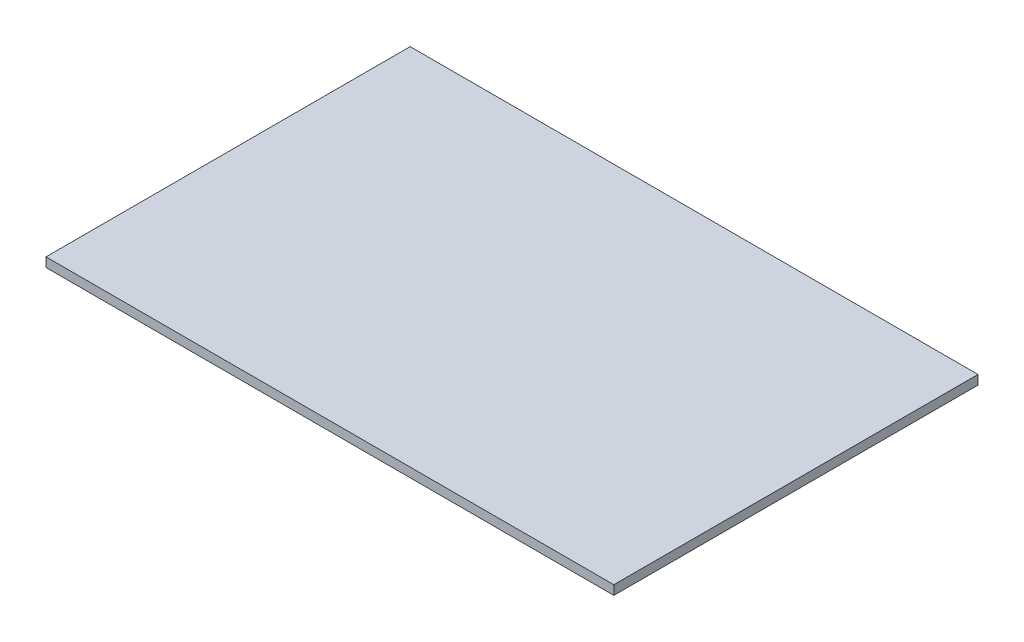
from build123d import *

# Parameters (mm, degrees)
SKETCH2_W           = 1168.4
SKETCH2_H           = 749.3
BOSS_EXTRUDE1_DEPTH = 19.05


with BuildPart() as part:
    # Sketch2 → Boss-Extrude1 (new body)
    with BuildSketch(Plane(origin=(0, 0, 0), x_dir=(1, 0, 0), z_dir=(0, 1, 0))):
        with Locations((584.2, 374.65)):
            Rectangle(SKETCH2_W, SKETCH2_H)
    extrude(amount=BOSS_EXTRUDE1_DEPTH)


solid = part.part
